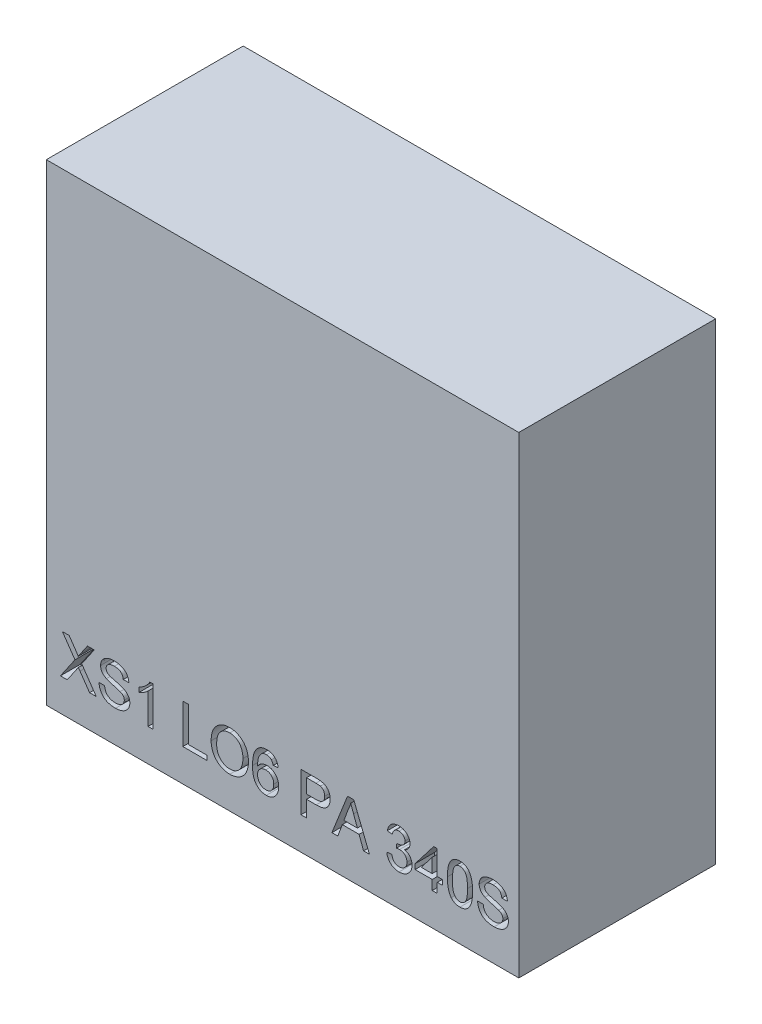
from build123d import *

# Parameters (mm, degrees)
ESQUISSE1_W             = 12
ESQUISSE1_H             = 12
EXTRUSION1_DEPTH        = 2.5
ENL_V_MAT_EXTRU_1_DEPTH = 0.5


with BuildPart() as part:
    # Esquisse1 → Extrusion1 (new, symmetric)
    with BuildSketch(Plane.XY):
        Rectangle(ESQUISSE1_W, ESQUISSE1_H)
    extrude(amount=EXTRUSION1_DEPTH, both=True)

    # Esquisse2 → Enl_v. mat.-Extru.1 (cut)
    # profile 1 of 12: a face of its own
    with BuildSketch(Plane.XY.offset(2.5)):
        with BuildLine():
            Line((-5.642281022, -5.175522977), (-5.272689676, -4.63746208))
            Line((-5.272689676, -4.63746208), (-5.590998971, -4.175522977))
            Line((-5.590998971, -4.175522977), (-5.421127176, -4.175522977))
            Line((-5.421127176, -4.175522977), (-5.246648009, -4.428728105))
            add(Edge.make_bspline(
                [(-5.246648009, -4.428728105), (-5.242364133, -4.435064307), (-5.234325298, -4.446954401), (-5.223150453, -4.463819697), (-5.214050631, -4.478787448), (-5.206443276, -4.491640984), (-5.20090615, -4.502590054), (-5.196861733, -4.51143256), (-5.194786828, -4.518440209), (-5.194771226, -4.522471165), (-5.194764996, -4.524080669)],
                knots=[0, 0, 0, 0, 1.676306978, 3.145645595, 4.433208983, 5.515054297, 6.418236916, 7.119612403, 7.648473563, 8, 8, 8, 8], degree=3))
            add(Edge.make_bspline(
                [(-5.194764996, -4.524080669), (-5.190487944, -4.517873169), (-5.181114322, -4.504268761), (-5.165991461, -4.482142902), (-5.148516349, -4.456622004), (-5.136074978, -4.438541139), (-5.129460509, -4.428928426)],
                knots=[0, 0, 0, 0, 0.783836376, 1.717861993, 2.786698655, 4, 4, 4, 4], degree=3))
            Line((-5.129460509, -4.428928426), (-4.955582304, -4.175522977))
            Line((-4.955582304, -4.175522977), (-4.783306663, -4.175522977))
            Line((-4.783306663, -4.175522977), (-5.101615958, -4.639064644))
            Line((-5.101615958, -4.639064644), (-4.732024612, -5.175522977))
            Line((-4.732024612, -5.175522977), (-4.902096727, -5.175522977))
            Line((-4.902096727, -5.175522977), (-5.14548615, -4.822157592))
            add(Edge.make_bspline(
                [(-5.14548615, -4.822157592), (-5.152441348, -4.812148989), (-5.166192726, -4.792360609), (-5.179817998, -4.772485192), (-5.186551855, -4.7626624)],
                knots=[0, 0, 0, 0, 1.011563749, 2, 2, 2, 2], degree=3))
            add(Edge.make_bspline(
                [(-5.186551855, -4.7626624), (-5.191679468, -4.770150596), (-5.201118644, -4.783935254), (-5.21425758, -4.80270564), (-5.224625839, -4.818254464), (-5.230881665, -4.827371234), (-5.233627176, -4.831372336)],
                knots=[0, 0, 0, 0, 1.307556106, 2.407017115, 3.300883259, 4, 4, 4, 4], degree=3))
            Line((-5.233627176, -4.831372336), (-5.470205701, -5.175522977))
            Line((-5.470205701, -5.175522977), (-5.642281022, -5.175522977))
        make_face()
    # profile 2 of 12: a face of its own
    with BuildSketch(Plane.XY.offset(2.5)):
        with BuildLine():
            Line((-4.66111115, -4.829369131), (-4.520085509, -4.829369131))
            add(Edge.make_bspline(
                [(-4.520085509, -4.829369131), (-4.518534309, -4.842031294), (-4.51555437, -4.866355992), (-4.507222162, -4.900832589), (-4.496498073, -4.931830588), (-4.483136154, -4.959761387), (-4.465559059, -4.984290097), (-4.444381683, -5.00641462), (-4.418662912, -5.025573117), (-4.389632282, -5.042622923), (-4.357300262, -5.056009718), (-4.322782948, -5.06593357), (-4.286244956, -5.071813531), (-4.261225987, -5.072571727), (-4.248450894, -5.072958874)],
                knots=[0, 0, 0, 0, 1.125557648, 2.162256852, 3.1243583, 4.018160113, 4.88511607, 5.777380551, 6.711250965, 7.707237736, 8.743031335, 9.791730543, 10.872421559, 12, 12, 12, 12], degree=3))
            add(Edge.make_bspline(
                [(-4.248450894, -5.072958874), (-4.237146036, -5.072749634), (-4.215103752, -5.072341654), (-4.183217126, -5.067440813), (-4.153211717, -5.060489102), (-4.125645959, -5.049973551), (-4.100621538, -5.037204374), (-4.078890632, -5.021759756), (-4.060337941, -5.004342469), (-4.045809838, -4.984493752), (-4.034396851, -4.963695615), (-4.026024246, -4.942317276), (-4.021036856, -4.920477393), (-4.020401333, -4.905782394), (-4.020085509, -4.898479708)],
                knots=[0, 0, 0, 0, 1.267006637, 2.470417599, 3.611360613, 4.716023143, 5.771382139, 6.754486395, 7.697536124, 8.612899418, 9.501261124, 10.352596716, 11.181322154, 12, 12, 12, 12], degree=3))
            add(Edge.make_bspline(
                [(-4.020085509, -4.898479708), (-4.02042313, -4.891250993), (-4.021083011, -4.87712248), (-4.025383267, -4.856553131), (-4.033556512, -4.837726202), (-4.044162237, -4.819873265), (-4.058916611, -4.803550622), (-4.077557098, -4.788510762), (-4.100494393, -4.77487548), (-4.117613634, -4.767408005), (-4.126656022, -4.763463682)],
                knots=[0, 0, 0, 0, 0.942140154, 1.841411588, 2.718743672, 3.605002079, 4.535543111, 5.568170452, 6.715506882, 8, 8, 8, 8], degree=3))
            add(Edge.make_bspline(
                [(-4.126656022, -4.763463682), (-4.13017907, -4.762017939), (-4.138138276, -4.758751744), (-4.151779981, -4.754427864), (-4.167967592, -4.748836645), (-4.187090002, -4.7430786), (-4.209044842, -4.736987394), (-4.233795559, -4.730093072), (-4.261328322, -4.722761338), (-4.290862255, -4.714957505), (-4.320682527, -4.707022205), (-4.349172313, -4.699079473), (-4.375384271, -4.691016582), (-4.399533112, -4.683253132), (-4.421494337, -4.675457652), (-4.441330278, -4.667843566), (-4.459065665, -4.660565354), (-4.469897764, -4.655213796), (-4.475013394, -4.652686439)],
                knots=[0, 0, 0, 0, 0.499201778, 1.127787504, 1.87543728, 2.745208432, 3.745951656, 4.863402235, 6.114490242, 7.482339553, 8.869366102, 10.161191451, 11.360587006, 12.46547846, 13.487450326, 14.41601931, 15.251940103, 16, 16, 16, 16], degree=3))
            add(Edge.make_bspline(
                [(-4.475013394, -4.652686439), (-4.486783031, -4.646328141), (-4.509501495, -4.634054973), (-4.540078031, -4.612110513), (-4.565841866, -4.587759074), (-4.586684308, -4.561035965), (-4.603017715, -4.532393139), (-4.614037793, -4.501781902), (-4.621585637, -4.469757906), (-4.622291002, -4.447736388), (-4.622649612, -4.436540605)],
                knots=[0, 0, 0, 0, 1.158441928, 2.236094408, 3.251151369, 4.220012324, 5.163146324, 6.095083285, 7.031536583, 8, 8, 8, 8], degree=3))
            add(Edge.make_bspline(
                [(-4.622649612, -4.436540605), (-4.622173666, -4.424143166), (-4.621227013, -4.399484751), (-4.612829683, -4.363300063), (-4.599435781, -4.328480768), (-4.584189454, -4.300837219), (-4.569320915, -4.279933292), (-4.556994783, -4.264878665), (-4.543168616, -4.250962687), (-4.52826821, -4.237991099), (-4.512027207, -4.226157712), (-4.494848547, -4.214976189), (-4.476110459, -4.205365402), (-4.449780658, -4.193133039), (-4.414557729, -4.18091788), (-4.370216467, -4.170273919), (-4.323548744, -4.164005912), (-4.291738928, -4.163143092), (-4.275494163, -4.162702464)],
                knots=[0, 0, 0, 0, 1.199927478, 2.386647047, 3.578628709, 4.806592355, 5.433127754, 6.062729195, 6.689531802, 7.331674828, 7.974827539, 8.635320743, 9.315455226, 10.01318112, 11.447700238, 12.918145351, 14.426146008, 16, 16, 16, 16], degree=3))
            add(Edge.make_bspline(
                [(-4.275494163, -4.162702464), (-4.257713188, -4.163109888), (-4.223090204, -4.163903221), (-4.17278203, -4.170503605), (-4.125858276, -4.181838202), (-4.089059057, -4.194526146), (-4.061853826, -4.207370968), (-4.042526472, -4.217393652), (-4.024586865, -4.2289817), (-4.007873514, -4.241521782), (-3.992231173, -4.255008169), (-3.978061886, -4.269761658), (-3.964750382, -4.285278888), (-3.949107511, -4.307556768), (-3.932241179, -4.337041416), (-3.91765794, -4.375239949), (-3.907639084, -4.415555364), (-3.905690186, -4.443426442), (-3.904700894, -4.457574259)],
                knots=[0, 0, 0, 0, 1.607600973, 3.130308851, 4.577334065, 5.967726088, 6.640410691, 7.296826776, 7.935019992, 8.569057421, 9.185393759, 9.8003086, 10.417295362, 11.032210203, 12.259799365, 13.477607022, 14.719591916, 16, 16, 16, 16], degree=3))
            Line((-3.904700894, -4.457574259), (-4.045726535, -4.457574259))
            add(Edge.make_bspline(
                [(-4.045726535, -4.457574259), (-4.046622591, -4.450413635), (-4.048375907, -4.436402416), (-4.052725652, -4.41611907), (-4.058823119, -4.39728081), (-4.065965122, -4.379711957), (-4.074622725, -4.363595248), (-4.084714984, -4.348775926), (-4.096364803, -4.335428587), (-4.109272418, -4.323200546), (-4.123830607, -4.312553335), (-4.139964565, -4.303311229), (-4.157701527, -4.295503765), (-4.177025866, -4.289109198), (-4.197941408, -4.284151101), (-4.220495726, -4.28050383), (-4.244680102, -4.278635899), (-4.261335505, -4.278273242), (-4.269885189, -4.27808708)],
                knots=[0, 0, 0, 0, 1.074487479, 2.102453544, 3.083708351, 4.020042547, 4.923259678, 5.803182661, 6.684453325, 7.556870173, 8.445961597, 9.363679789, 10.320905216, 11.327237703, 12.390948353, 13.519046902, 14.726457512, 16, 16, 16, 16], degree=3))
            add(Edge.make_bspline(
                [(-4.269885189, -4.27808708), (-4.278772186, -4.278154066), (-4.295975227, -4.278283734), (-4.320844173, -4.280647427), (-4.343894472, -4.283890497), (-4.365086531, -4.288674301), (-4.38435093, -4.294936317), (-4.401973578, -4.302167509), (-4.417461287, -4.311331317), (-4.431175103, -4.321538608), (-4.443005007, -4.332832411), (-4.453200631, -4.344733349), (-4.462217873, -4.356891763), (-4.46922447, -4.369972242), (-4.474928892, -4.383479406), (-4.478608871, -4.397667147), (-4.481214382, -4.412273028), (-4.481485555, -4.422238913), (-4.481623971, -4.427325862)],
                knots=[0, 0, 0, 0, 1.464176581, 2.834285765, 4.113735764, 5.29917439, 6.409476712, 7.449999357, 8.431575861, 9.367089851, 10.262376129, 11.120706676, 11.948504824, 12.751342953, 13.560717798, 14.359016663, 15.162382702, 16, 16, 16, 16], degree=3))
            add(Edge.make_bspline(
                [(-4.481623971, -4.427325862), (-4.481259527, -4.435929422), (-4.480552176, -4.45262814), (-4.473329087, -4.476351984), (-4.462219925, -4.497977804), (-4.45127563, -4.509744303), (-4.445766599, -4.515667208)],
                knots=[0, 0, 0, 0, 1.050964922, 2.039826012, 3.013306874, 4, 4, 4, 4], degree=3))
            add(Edge.make_bspline(
                [(-4.445766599, -4.515667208), (-4.442293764, -4.518627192), (-4.434613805, -4.525173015), (-4.420324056, -4.533835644), (-4.402606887, -4.542588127), (-4.381343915, -4.551288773), (-4.356571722, -4.560043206), (-4.328330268, -4.569056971), (-4.296511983, -4.578009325), (-4.26208653, -4.5866364), (-4.227308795, -4.595298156), (-4.194258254, -4.603926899), (-4.163912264, -4.612104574), (-4.136318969, -4.620080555), (-4.11144981, -4.627832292), (-4.089391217, -4.635522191), (-4.069964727, -4.642594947), (-4.058063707, -4.647571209), (-4.052537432, -4.649881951)],
                knots=[0, 0, 0, 0, 0.523891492, 1.158553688, 1.913783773, 2.794766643, 3.797521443, 4.933638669, 6.202080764, 7.596537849, 9.013317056, 10.322179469, 11.523240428, 12.626146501, 13.623953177, 14.517289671, 15.311498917, 16, 16, 16, 16], degree=3))
            add(Edge.make_bspline(
                [(-4.052537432, -4.649881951), (-4.045347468, -4.653196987), (-4.031234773, -4.659703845), (-4.01124225, -4.670813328), (-3.992587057, -4.682349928), (-3.975419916, -4.694624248), (-3.959796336, -4.707662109), (-3.945541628, -4.721314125), (-3.932569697, -4.735503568), (-3.92140396, -4.750684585), (-3.911378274, -4.76624349), (-3.902605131, -4.782397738), (-3.895541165, -4.79924233), (-3.889345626, -4.816574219), (-3.884889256, -4.834586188), (-3.881394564, -4.853096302), (-3.879356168, -4.872191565), (-3.879159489, -4.885120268), (-3.879059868, -4.89166881)],
                knots=[0, 0, 0, 0, 1.198900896, 2.353241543, 3.461831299, 4.520043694, 5.547003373, 6.541368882, 7.508191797, 8.454912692, 9.392021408, 10.310662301, 11.235020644, 12.156274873, 13.095836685, 14.042125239, 15.00831306, 16, 16, 16, 16], degree=3))
            add(Edge.make_bspline(
                [(-3.879059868, -4.89166881), (-3.879581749, -4.904737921), (-3.880617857, -4.930684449), (-3.889539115, -4.968930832), (-3.903553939, -5.005991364), (-3.919989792, -5.035400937), (-3.935526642, -5.057865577), (-3.948578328, -5.074012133), (-3.963051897, -5.088942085), (-3.978591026, -5.10312316), (-3.99531636, -5.116266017), (-4.013368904, -5.128375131), (-4.032558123, -5.139576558), (-4.059959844, -5.153226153), (-4.096353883, -5.167504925), (-4.142712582, -5.179395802), (-4.191569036, -5.187109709), (-4.225116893, -5.187926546), (-4.242240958, -5.18834349)],
                knots=[0, 0, 0, 0, 1.197055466, 2.376552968, 3.581957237, 4.820753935, 5.454298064, 6.085440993, 6.72202542, 7.359198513, 8.013298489, 8.67051481, 9.351020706, 10.049282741, 11.476266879, 12.925760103, 14.430794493, 16, 16, 16, 16], degree=3))
            add(Edge.make_bspline(
                [(-4.242240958, -5.18834349), (-4.253128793, -5.188253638), (-4.274456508, -5.188077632), (-4.305795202, -5.185946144), (-4.335827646, -5.182862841), (-4.364524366, -5.178270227), (-4.391795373, -5.172244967), (-4.417738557, -5.165009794), (-4.44241541, -5.156677), (-4.465739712, -5.14687778), (-4.487650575, -5.135492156), (-4.508541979, -5.123209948), (-4.528072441, -5.10928749), (-4.546283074, -5.093943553), (-4.563635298, -5.077621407), (-4.579409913, -5.059654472), (-4.594143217, -5.040568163), (-4.607498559, -5.020187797), (-4.619429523, -4.998780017), (-4.630158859, -4.976704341), (-4.639198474, -4.95380063), (-4.646483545, -4.930184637), (-4.652654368, -4.906014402), (-4.656933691, -4.881088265), (-4.660079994, -4.855484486), (-4.660765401, -4.838125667), (-4.66111115, -4.829369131)],
                knots=[0, 0, 0, 0, 1.259822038, 2.467811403, 3.633536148, 4.752793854, 5.829021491, 6.863980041, 7.868367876, 8.841470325, 9.788447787, 10.724101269, 11.643985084, 12.560193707, 13.478453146, 14.398077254, 15.323914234, 16.266973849, 17.21495974, 18.158525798, 19.105629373, 20.061269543, 21.017128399, 21.990322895, 22.986232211, 24, 24, 24, 24], degree=3))
        make_face()
    # profile 3 of 12: a face of its own
    with BuildSketch(Plane.XY.offset(2.5)):
        with BuildLine():
            Line((-3.289316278, -5.175522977), (-3.417521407, -5.175522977))
            Line((-3.417521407, -5.175522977), (-3.417521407, -4.396276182))
            add(Edge.make_bspline(
                [(-3.417521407, -4.396276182), (-3.424903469, -4.403395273), (-3.440246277, -4.418191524), (-3.466181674, -4.439131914), (-3.495128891, -4.460355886), (-3.52671203, -4.480765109), (-3.558905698, -4.499978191), (-3.590016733, -4.517257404), (-3.619525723, -4.531879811), (-3.638963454, -4.539875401), (-3.648290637, -4.54371208)],
                knots=[0, 0, 0, 0, 0.893362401, 1.856755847, 2.901947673, 4.020460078, 5.132200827, 6.168787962, 7.121294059, 8, 8, 8, 8], degree=3))
            Line((-3.648290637, -4.54371208), (-3.648290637, -4.425522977))
            add(Edge.make_bspline(
                [(-3.648290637, -4.425522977), (-3.632270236, -4.417272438), (-3.600694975, -4.401011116), (-3.556085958, -4.372925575), (-3.514438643, -4.342479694), (-3.476442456, -4.309680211), (-3.442381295, -4.276153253), (-3.413677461, -4.242323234), (-3.389659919, -4.209430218), (-3.377609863, -4.186490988), (-3.37184833, -4.175522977)],
                knots=[0, 0, 0, 0, 1.141258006, 2.249351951, 3.335817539, 4.406819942, 5.426913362, 6.360259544, 7.215985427, 8, 8, 8, 8], degree=3))
            Line((-3.37184833, -4.175522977), (-3.289316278, -4.175522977))
            Line((-3.289316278, -4.175522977), (-3.289316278, -5.175522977))
        make_face()
    # profile 4 of 12: a face of its own
    with BuildSketch(Plane.XY.offset(2.5)):
        Polygon((-2.532906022, -5.175522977), (-2.532906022, -4.175522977), (-2.391880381, -4.175522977), (-2.391880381, -5.060138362), (-1.917521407, -5.060138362), (-1.917521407, -5.175522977), align=None)
    # profile 5 of 12: a face of its own
    with BuildSketch(Plane.XY.offset(2.5)):
        with BuildLine():
            add(Edge.make_bspline(
                [(-1.814957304, -4.688744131), (-1.814609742, -4.668694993), (-1.813932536, -4.629630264), (-1.807605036, -4.572746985), (-1.797330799, -4.519227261), (-1.782642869, -4.46907526), (-1.764025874, -4.422212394), (-1.741393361, -4.37853255), (-1.714064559, -4.338530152), (-1.683148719, -4.301824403), (-1.648617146, -4.26937383), (-1.611850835, -4.240553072), (-1.572390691, -4.216513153), (-1.530601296, -4.196664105), (-1.486305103, -4.18142458), (-1.439626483, -4.170755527), (-1.390615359, -4.16387295), (-1.357115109, -4.163098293), (-1.339997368, -4.162702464)],
                knots=[0, 0, 0, 0, 1.203621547, 2.345195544, 3.432004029, 4.472479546, 5.478447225, 6.455936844, 7.420185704, 8.381829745, 9.332027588, 10.260832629, 11.182364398, 12.100723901, 13.034044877, 13.989196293, 14.972532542, 16, 16, 16, 16], degree=3))
            add(Edge.make_bspline(
                [(-1.339997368, -4.162702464), (-1.328707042, -4.162899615), (-1.306286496, -4.163291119), (-1.273139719, -4.166269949), (-1.240844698, -4.171586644), (-1.209433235, -4.178711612), (-1.178819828, -4.18805926), (-1.148986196, -4.199093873), (-1.120193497, -4.212767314), (-1.092250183, -4.22807609), (-1.065486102, -4.245199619), (-1.040333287, -4.264115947), (-1.016851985, -4.28468201), (-0.994726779, -4.306559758), (-0.974695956, -4.330487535), (-0.955931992, -4.35573646), (-0.93897408, -4.382754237), (-0.92376205, -4.411319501), (-0.910160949, -4.440991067), (-0.898536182, -4.471891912), (-0.888554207, -4.503651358), (-0.880198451, -4.536457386), (-0.874202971, -4.570298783), (-0.869428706, -4.605029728), (-0.866915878, -4.640763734), (-0.866466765, -4.664902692), (-0.866239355, -4.677125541)],
                knots=[0, 0, 0, 0, 1.034375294, 2.054082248, 3.045783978, 4.031219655, 5.002789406, 5.976610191, 6.94273282, 7.920236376, 8.894345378, 9.851183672, 10.800797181, 11.752517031, 12.698794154, 13.65688337, 14.632873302, 15.61821402, 16.620222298, 17.621258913, 18.640965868, 19.669244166, 20.720417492, 21.788124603, 22.880008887, 24, 24, 24, 24], degree=3))
            add(Edge.make_bspline(
                [(-0.866239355, -4.677125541), (-0.866447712, -4.689549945), (-0.866859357, -4.714096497), (-0.869644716, -4.750359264), (-0.874542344, -4.785581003), (-0.881038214, -4.819866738), (-0.889742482, -4.853145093), (-0.900086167, -4.885511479), (-0.912597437, -4.916773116), (-0.926727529, -4.947005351), (-0.942715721, -4.975792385), (-0.960351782, -5.002932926), (-0.979648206, -5.028173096), (-1.000311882, -5.051822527), (-1.022825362, -5.073458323), (-1.046911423, -5.093282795), (-1.072477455, -5.111482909), (-1.099609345, -5.127565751), (-1.127820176, -5.141662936), (-1.1565517, -5.154169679), (-1.185825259, -5.164835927), (-1.2157409, -5.173479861), (-1.246217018, -5.18001184), (-1.277167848, -5.184903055), (-1.308694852, -5.187719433), (-1.32990919, -5.188134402), (-1.34059833, -5.18834349)],
                knots=[0, 0, 0, 0, 1.141429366, 2.255090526, 3.338676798, 4.407031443, 5.458968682, 6.496860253, 7.526652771, 8.550250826, 9.560787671, 10.54935636, 11.521089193, 12.477323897, 13.431786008, 14.386110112, 15.340986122, 16.312041, 17.28047646, 18.236612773, 19.189437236, 20.140779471, 21.09494583, 22.051062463, 23.018000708, 24, 24, 24, 24], degree=3))
            add(Edge.make_bspline(
                [(-1.34059833, -5.18834349), (-1.352091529, -5.188173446), (-1.374856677, -5.187836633), (-1.40850418, -5.184474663), (-1.441314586, -5.179345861), (-1.473192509, -5.171941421), (-1.50409439, -5.162281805), (-1.534056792, -5.150590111), (-1.563185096, -5.137022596), (-1.591117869, -5.121190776), (-1.617760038, -5.103587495), (-1.642853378, -5.084300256), (-1.666384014, -5.06350681), (-1.687974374, -5.040863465), (-1.708323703, -5.017191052), (-1.726618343, -4.991609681), (-1.743455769, -4.964699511), (-1.758337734, -4.93620114), (-1.771781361, -4.906961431), (-1.783107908, -4.876971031), (-1.793061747, -4.846671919), (-1.800988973, -4.815877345), (-1.807306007, -4.784658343), (-1.811553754, -4.753066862), (-1.81462151, -4.721055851), (-1.814844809, -4.699568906), (-1.814957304, -4.688744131)],
                knots=[0, 0, 0, 0, 1.072727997, 2.12480551, 3.153819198, 4.171534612, 5.177148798, 6.173931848, 7.17235114, 8.174500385, 9.168706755, 10.151274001, 11.127173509, 12.097141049, 13.070188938, 14.039134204, 15.03036519, 16.031505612, 17.038625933, 18.033164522, 19.022845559, 20.014762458, 21.000193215, 21.994692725, 22.989758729, 24, 24, 24, 24], degree=3))
        make_face()
        with BuildLine():
            add(Edge.make_bspline(
                [(-1.673931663, -4.690346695), (-1.673715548, -4.704783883), (-1.673294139, -4.732935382), (-1.668472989, -4.773978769), (-1.661157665, -4.812705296), (-1.651074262, -4.849223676), (-1.6375197, -4.883172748), (-1.621313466, -4.914878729), (-1.601909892, -4.944130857), (-1.579737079, -4.970847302), (-1.555349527, -4.994847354), (-1.529288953, -5.015810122), (-1.501549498, -5.033364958), (-1.472438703, -5.047860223), (-1.44174748, -5.059175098), (-1.409567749, -5.067120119), (-1.375875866, -5.072089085), (-1.352902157, -5.072665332), (-1.341199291, -5.072958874)],
                knots=[0, 0, 0, 0, 1.215430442, 2.370003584, 3.475209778, 4.53279855, 5.55522989, 6.548792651, 7.526809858, 8.505409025, 9.467826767, 10.404123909, 11.316848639, 12.227335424, 13.138360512, 14.065900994, 15.014765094, 16, 16, 16, 16], degree=3))
            add(Edge.make_bspline(
                [(-1.341199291, -5.072958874), (-1.329298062, -5.072660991), (-1.305995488, -5.072077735), (-1.271795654, -5.067195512), (-1.239301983, -5.058883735), (-1.208192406, -5.047818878), (-1.179029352, -5.032861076), (-1.151130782, -5.015345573), (-1.125257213, -4.99394213), (-1.100773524, -4.969899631), (-1.078813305, -4.942570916), (-1.059328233, -4.912629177), (-1.043499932, -4.879625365), (-1.02983433, -4.844286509), (-1.019827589, -4.80594469), (-1.012431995, -4.765035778), (-1.007975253, -4.721428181), (-1.007505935, -4.691492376), (-1.007264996, -4.676123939)],
                knots=[0, 0, 0, 0, 0.976878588, 1.912725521, 2.8289017, 3.727303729, 4.617335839, 5.514666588, 6.426584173, 7.368641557, 8.327632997, 9.299405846, 10.294892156, 11.327373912, 12.405931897, 13.542618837, 14.738430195, 16, 16, 16, 16], degree=3))
            add(Edge.make_bspline(
                [(-1.007264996, -4.676123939), (-1.007350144, -4.666236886), (-1.007517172, -4.646842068), (-1.009729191, -4.618253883), (-1.012582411, -4.590554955), (-1.016926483, -4.563781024), (-1.022913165, -4.538042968), (-1.029545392, -4.513144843), (-1.037838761, -4.489301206), (-1.047248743, -4.466418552), (-1.057778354, -4.444614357), (-1.069654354, -4.424072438), (-1.082738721, -4.404872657), (-1.096678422, -4.386651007), (-1.11224536, -4.37011274), (-1.128689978, -4.354559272), (-1.146385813, -4.34031194), (-1.165156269, -4.327367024), (-1.184735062, -4.315714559), (-1.205081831, -4.305741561), (-1.225872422, -4.296981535), (-1.247454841, -4.290266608), (-1.269531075, -4.28485092), (-1.29219037, -4.280737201), (-1.31551683, -4.278606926), (-1.331246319, -4.278261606), (-1.339196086, -4.27808708)],
                knots=[0, 0, 0, 0, 1.220438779, 2.394059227, 3.538503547, 4.658058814, 5.74010225, 6.800155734, 7.837851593, 8.854470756, 9.853724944, 10.825214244, 11.781044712, 12.72106398, 13.654479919, 14.581868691, 15.514082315, 16.456304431, 17.39516604, 18.324312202, 19.252140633, 20.177768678, 21.111585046, 22.057694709, 23.018348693, 24, 24, 24, 24], degree=3))
            add(Edge.make_bspline(
                [(-1.339196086, -4.27808708), (-1.350431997, -4.27831022), (-1.372601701, -4.278750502), (-1.405238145, -4.283644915), (-1.436703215, -4.290957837), (-1.467045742, -4.301181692), (-1.496006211, -4.314719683), (-1.523734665, -4.331322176), (-1.550477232, -4.350537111), (-1.575812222, -4.372832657), (-1.599429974, -4.398444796), (-1.619396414, -4.428640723), (-1.636224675, -4.462699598), (-1.650275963, -4.500535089), (-1.660989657, -4.542440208), (-1.668394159, -4.588234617), (-1.67306921, -4.637966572), (-1.673636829, -4.672440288), (-1.673931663, -4.690346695)],
                knots=[0, 0, 0, 0, 0.895090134, 1.766112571, 2.624765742, 3.468151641, 4.313618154, 5.168136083, 6.041303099, 6.935189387, 7.854749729, 8.809996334, 9.809869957, 10.877771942, 12.021723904, 13.25217762, 14.572720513, 16, 16, 16, 16], degree=3))
        make_face(mode=Mode.SUBTRACT)
    # profile 6 of 12: a face of its own
    with BuildSketch(Plane.XY.offset(2.5)):
        with BuildLine():
            Line((-0.109829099, -4.431933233), (-0.238034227, -4.444753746))
            add(Edge.make_bspline(
                [(-0.238034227, -4.444753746), (-0.240800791, -4.433727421), (-0.246008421, -4.412972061), (-0.256928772, -4.384820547), (-0.268962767, -4.361009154), (-0.279417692, -4.348187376), (-0.284308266, -4.342189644)],
                knots=[0, 0, 0, 0, 1.199207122, 2.257322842, 3.184815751, 4, 4, 4, 4], degree=3))
            add(Edge.make_bspline(
                [(-0.284308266, -4.342189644), (-0.288506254, -4.338098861), (-0.296762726, -4.330053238), (-0.310316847, -4.319565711), (-0.324605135, -4.310680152), (-0.339670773, -4.303481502), (-0.355432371, -4.297794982), (-0.371955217, -4.293816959), (-0.389201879, -4.291354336), (-0.400953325, -4.291057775), (-0.406904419, -4.290907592)],
                knots=[0, 0, 0, 0, 1.028360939, 2.022547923, 3.001693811, 3.976902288, 4.948369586, 5.937776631, 6.955661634, 8, 8, 8, 8], degree=3))
            add(Edge.make_bspline(
                [(-0.406904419, -4.290907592), (-0.416552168, -4.291218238), (-0.435615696, -4.29183206), (-0.463585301, -4.29784133), (-0.490751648, -4.306835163), (-0.507582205, -4.315952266), (-0.516079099, -4.320555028)],
                knots=[0, 0, 0, 0, 1.010336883, 1.996381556, 2.988474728, 4, 4, 4, 4], degree=3))
            add(Edge.make_bspline(
                [(-0.516079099, -4.320555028), (-0.524435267, -4.327478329), (-0.54158848, -4.34169021), (-0.563973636, -4.367950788), (-0.583992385, -4.398525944), (-0.598756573, -4.42707018), (-0.60914714, -4.452662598), (-0.615867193, -4.474596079), (-0.621608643, -4.498828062), (-0.626391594, -4.525312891), (-0.630090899, -4.554072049), (-0.633182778, -4.585123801), (-0.634892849, -4.618546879), (-0.635273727, -4.641600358), (-0.635470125, -4.653487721)],
                knots=[0, 0, 0, 0, 1.063306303, 2.18271343, 3.369442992, 4.644240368, 5.329284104, 6.077448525, 6.892756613, 7.771869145, 8.717113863, 9.73749892, 10.833357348, 12, 12, 12, 12], degree=3))
            add(Edge.make_bspline(
                [(-0.635470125, -4.653487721), (-0.627911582, -4.642868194), (-0.613115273, -4.622079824), (-0.587013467, -4.594887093), (-0.5585115, -4.571900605), (-0.527577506, -4.553547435), (-0.49501865, -4.539323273), (-0.461552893, -4.529087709), (-0.42723889, -4.522804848), (-0.4041261, -4.522054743), (-0.392481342, -4.521676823)],
                knots=[0, 0, 0, 0, 1.083917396, 2.121834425, 3.126226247, 4.123362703, 5.106535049, 6.077135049, 7.031216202, 8, 8, 8, 8], degree=3))
            add(Edge.make_bspline(
                [(-0.392481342, -4.521676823), (-0.382452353, -4.521946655), (-0.362638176, -4.52247976), (-0.333459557, -4.52670437), (-0.305485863, -4.534093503), (-0.278474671, -4.543719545), (-0.252945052, -4.556862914), (-0.228273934, -4.572223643), (-0.205032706, -4.590915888), (-0.182927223, -4.611918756), (-0.16280104, -4.635269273), (-0.144987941, -4.660401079), (-0.130143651, -4.687374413), (-0.118106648, -4.71600863), (-0.10868559, -4.746199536), (-0.101840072, -4.778032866), (-0.097832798, -4.811571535), (-0.097287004, -4.834499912), (-0.097008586, -4.846196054)],
                knots=[0, 0, 0, 0, 0.981553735, 1.939246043, 2.877808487, 3.810434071, 4.740031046, 5.683044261, 6.650811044, 7.654063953, 8.664382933, 9.663624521, 10.66421212, 11.671863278, 12.699354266, 13.755775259, 14.855184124, 16, 16, 16, 16], degree=3))
            add(Edge.make_bspline(
                [(-0.097008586, -4.846196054), (-0.097507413, -4.861653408), (-0.098491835, -4.892158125), (-0.106393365, -4.937080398), (-0.119125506, -4.980381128), (-0.13435637, -5.014671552), (-0.148349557, -5.04094168), (-0.160231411, -5.059316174), (-0.172936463, -5.076583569), (-0.186224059, -5.092981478), (-0.201057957, -5.107759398), (-0.216538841, -5.121613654), (-0.233178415, -5.134065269), (-0.250487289, -5.145528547), (-0.26879244, -5.155468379), (-0.287561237, -5.164300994), (-0.306948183, -5.171824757), (-0.327015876, -5.177732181), (-0.34766154, -5.182619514), (-0.368953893, -5.185980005), (-0.390836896, -5.188052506), (-0.405631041, -5.188245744), (-0.413114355, -5.18834349)],
                knots=[0, 0, 0, 0, 1.777979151, 3.508799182, 5.232661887, 6.960203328, 7.816385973, 8.656273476, 9.47551652, 10.283326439, 11.082130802, 11.882412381, 12.672407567, 13.471692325, 14.269609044, 15.067192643, 15.857822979, 16.66013129, 17.472860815, 18.297850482, 19.139002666, 20, 20, 20, 20], degree=3))
            add(Edge.make_bspline(
                [(-0.413114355, -5.18834349), (-0.425752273, -5.187993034), (-0.450537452, -5.187305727), (-0.486814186, -5.18202553), (-0.521260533, -5.173201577), (-0.553949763, -5.160864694), (-0.58498146, -5.145289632), (-0.614049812, -5.125765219), (-0.641315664, -5.102870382), (-0.666800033, -5.076472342), (-0.689906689, -5.045990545), (-0.709654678, -5.010805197), (-0.726481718, -4.971224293), (-0.740253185, -4.927138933), (-0.750674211, -4.878503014), (-0.758177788, -4.82542099), (-0.762792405, -4.76788526), (-0.76337409, -4.728015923), (-0.763675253, -4.707373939)],
                knots=[0, 0, 0, 0, 0.898506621, 1.76212948, 2.600594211, 3.422599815, 4.24233914, 5.064166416, 5.906856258, 6.769969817, 7.668413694, 8.619051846, 9.63165591, 10.722000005, 11.898403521, 13.164960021, 14.532183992, 16, 16, 16, 16], degree=3))
            add(Edge.make_bspline(
                [(-0.763675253, -4.707373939), (-0.763625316, -4.695619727), (-0.763526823, -4.672436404), (-0.761944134, -4.638316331), (-0.760128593, -4.605365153), (-0.757017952, -4.57371433), (-0.753345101, -4.543221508), (-0.748416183, -4.514066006), (-0.743123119, -4.486021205), (-0.736687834, -4.459307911), (-0.729514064, -4.433674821), (-0.721256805, -4.409403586), (-0.712535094, -4.38618018), (-0.702640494, -4.364370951), (-0.692095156, -4.343620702), (-0.680438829, -4.324313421), (-0.668214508, -4.306007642), (-0.659190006, -4.294719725), (-0.654700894, -4.289104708)],
                knots=[0, 0, 0, 0, 1.28053818, 2.525659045, 3.721026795, 4.875695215, 5.990149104, 7.066600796, 8.096771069, 9.099076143, 10.059445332, 10.995815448, 11.891625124, 12.761078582, 13.603822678, 14.426062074, 15.217066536, 16, 16, 16, 16], degree=3))
            add(Edge.make_bspline(
                [(-0.654700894, -4.289104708), (-0.646625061, -4.280020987), (-0.630706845, -4.26211613), (-0.603475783, -4.238987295), (-0.574458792, -4.219231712), (-0.543193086, -4.203270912), (-0.509917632, -4.190827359), (-0.474611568, -4.181794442), (-0.437176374, -4.176555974), (-0.411595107, -4.175872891), (-0.398490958, -4.175522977)],
                knots=[0, 0, 0, 0, 1.005002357, 1.980952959, 2.948226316, 3.90482984, 4.879026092, 5.883055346, 6.915583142, 8, 8, 8, 8], degree=3))
            add(Edge.make_bspline(
                [(-0.398490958, -4.175522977), (-0.388733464, -4.175695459), (-0.369564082, -4.176034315), (-0.341476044, -4.179285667), (-0.314759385, -4.184719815), (-0.289354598, -4.192049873), (-0.265409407, -4.201807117), (-0.242647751, -4.213370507), (-0.221300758, -4.227280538), (-0.201522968, -4.243347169), (-0.183265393, -4.261114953), (-0.166912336, -4.280733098), (-0.152525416, -4.301957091), (-0.139992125, -4.324831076), (-0.129424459, -4.349246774), (-0.12074788, -4.375309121), (-0.1141531, -4.403011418), (-0.111290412, -4.422158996), (-0.109829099, -4.431933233)],
                knots=[0, 0, 0, 0, 1.095988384, 2.15315746, 3.171326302, 4.156539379, 5.119213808, 6.072133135, 7.021027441, 7.975952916, 8.930907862, 9.879001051, 10.840359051, 11.807350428, 12.805278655, 13.825435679, 14.889953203, 16, 16, 16, 16], degree=3))
        make_face()
        with BuildLine():
            add(Edge.make_bspline(
                [(-0.635470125, -4.843591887), (-0.635113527, -4.85363029), (-0.634405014, -4.873575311), (-0.628985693, -4.903180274), (-0.620135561, -4.932065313), (-0.608006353, -4.959909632), (-0.593029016, -4.985779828), (-0.57523943, -5.008702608), (-0.555023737, -5.028341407), (-0.532490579, -5.044738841), (-0.50769285, -5.057339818), (-0.481074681, -5.066466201), (-0.452604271, -5.071982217), (-0.432970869, -5.072628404), (-0.42293006, -5.072958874)],
                knots=[0, 0, 0, 0, 1.034121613, 2.054667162, 3.090870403, 4.141799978, 5.178094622, 6.163726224, 7.122467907, 8.07367165, 9.024701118, 9.977919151, 10.965878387, 12, 12, 12, 12], degree=3))
            add(Edge.make_bspline(
                [(-0.42293006, -5.072958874), (-0.415774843, -5.072765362), (-0.401808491, -5.072387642), (-0.381359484, -5.069460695), (-0.361848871, -5.064959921), (-0.343389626, -5.058310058), (-0.326006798, -5.049823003), (-0.30961013, -5.039493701), (-0.294210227, -5.027291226), (-0.279993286, -5.013237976), (-0.267144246, -4.997608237), (-0.255980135, -4.980497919), (-0.246121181, -4.962188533), (-0.238705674, -4.942230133), (-0.23266311, -4.921134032), (-0.228220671, -4.898700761), (-0.225612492, -4.874904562), (-0.225348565, -4.858555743), (-0.225213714, -4.850202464)],
                knots=[0, 0, 0, 0, 1.023436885, 1.997658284, 2.950132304, 3.883974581, 4.798406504, 5.712938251, 6.651509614, 7.604127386, 8.56812849, 9.540661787, 10.523651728, 11.536824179, 12.580180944, 13.661349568, 14.805088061, 16, 16, 16, 16], degree=3))
            add(Edge.make_bspline(
                [(-0.225213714, -4.850202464), (-0.225338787, -4.842180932), (-0.225583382, -4.826493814), (-0.228335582, -4.803602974), (-0.232344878, -4.781963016), (-0.238499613, -4.761756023), (-0.246053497, -4.742768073), (-0.25551843, -4.725141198), (-0.266546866, -4.708725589), (-0.279477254, -4.693955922), (-0.293617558, -4.680499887), (-0.309147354, -4.668812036), (-0.325880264, -4.658941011), (-0.343876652, -4.650859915), (-0.363170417, -4.644666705), (-0.383721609, -4.640374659), (-0.40541459, -4.637378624), (-0.420315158, -4.637168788), (-0.427938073, -4.637061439)],
                knots=[0, 0, 0, 0, 1.155658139, 2.260035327, 3.319019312, 4.323913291, 5.299809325, 6.260058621, 7.202437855, 8.144128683, 9.083751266, 10.011616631, 10.939332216, 11.87851101, 12.849505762, 13.853846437, 14.90205895, 16, 16, 16, 16], degree=3))
            add(Edge.make_bspline(
                [(-0.427938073, -4.637061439), (-0.435027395, -4.637172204), (-0.448997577, -4.637390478), (-0.469484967, -4.640409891), (-0.489230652, -4.644710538), (-0.508155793, -4.650967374), (-0.526266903, -4.659024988), (-0.543559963, -4.668826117), (-0.559884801, -4.680651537), (-0.575390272, -4.693894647), (-0.589538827, -4.708605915), (-0.601952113, -4.724521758), (-0.612076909, -4.74174457), (-0.620927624, -4.759853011), (-0.627412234, -4.77927395), (-0.632026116, -4.799747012), (-0.634886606, -4.821275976), (-0.635272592, -4.836037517), (-0.635470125, -4.843591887)],
                knots=[0, 0, 0, 0, 1.036988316, 2.04348404, 3.025371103, 3.992992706, 4.955812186, 5.923433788, 6.897355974, 7.902569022, 8.905116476, 9.880852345, 10.849905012, 11.825004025, 12.826645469, 13.839294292, 14.894236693, 16, 16, 16, 16], degree=3))
        make_face(mode=Mode.SUBTRACT)
    # profile 7 of 12: a face of its own
    with BuildSketch(Plane.XY.offset(2.5)):
        with BuildLine():
            Line((0.467093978, -5.175522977), (0.467093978, -4.175522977))
            Line((0.467093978, -4.175522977), (0.834481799, -4.175522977))
            add(Edge.make_bspline(
                [(0.834481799, -4.175522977), (0.849709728, -4.175609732), (0.87830785, -4.175772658), (0.91824476, -4.177680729), (0.952539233, -4.180041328), (0.973253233, -4.183402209), (0.982718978, -4.184938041)],
                knots=[0, 0, 0, 0, 1.22865052, 2.30741144, 3.226532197, 4, 4, 4, 4], degree=3))
            add(Edge.make_bspline(
                [(0.982718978, -4.184938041), (0.994264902, -4.18716008), (1.016644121, -4.191467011), (1.048329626, -4.201850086), (1.077196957, -4.214771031), (1.103200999, -4.230869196), (1.126773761, -4.249780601), (1.147579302, -4.272440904), (1.166021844, -4.29834414), (1.181703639, -4.327470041), (1.19475633, -4.358809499), (1.203898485, -4.392196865), (1.209754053, -4.427052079), (1.21037039, -4.450872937), (1.210683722, -4.462982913)],
                knots=[0, 0, 0, 0, 1.070909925, 2.075721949, 3.031861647, 3.947440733, 4.85625699, 5.777986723, 6.742441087, 7.747548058, 8.78749499, 9.830146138, 10.896896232, 12, 12, 12, 12], degree=3))
            add(Edge.make_bspline(
                [(1.210683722, -4.462982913), (1.210462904, -4.473344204), (1.210028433, -4.493730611), (1.206297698, -4.523681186), (1.200413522, -4.552494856), (1.191636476, -4.579974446), (1.180906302, -4.606441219), (1.167383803, -4.631448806), (1.151593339, -4.65533679), (1.133476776, -4.678040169), (1.112148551, -4.69909824), (1.086488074, -4.716961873), (1.056990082, -4.731962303), (1.023647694, -4.744082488), (0.986541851, -4.753619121), (0.945550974, -4.760606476), (0.900595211, -4.764464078), (0.869344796, -4.76499222), (0.853111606, -4.765266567)],
                knots=[0, 0, 0, 0, 0.928769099, 1.82740408, 2.702266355, 3.562020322, 4.410419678, 5.259600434, 6.10654066, 6.975254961, 7.860221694, 8.783881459, 9.766664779, 10.81996744, 11.958551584, 13.197863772, 14.544415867, 16, 16, 16, 16], degree=3))
            Line((0.853111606, -4.765266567), (0.608119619, -4.765266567))
            Line((0.608119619, -4.765266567), (0.608119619, -5.175522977))
            Line((0.608119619, -5.175522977), (0.467093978, -5.175522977))
        make_face()
        with BuildLine():
            Line((0.608119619, -4.649881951), (0.849305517, -4.649881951))
            add(Edge.make_bspline(
                [(0.849305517, -4.649881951), (0.858924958, -4.649721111), (0.87745592, -4.649411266), (0.904232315, -4.647249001), (0.928806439, -4.64350622), (0.951246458, -4.638286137), (0.971580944, -4.631797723), (0.989773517, -4.623591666), (1.005730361, -4.613748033), (1.019557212, -4.602367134), (1.031426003, -4.589617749), (1.041710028, -4.575708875), (1.050447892, -4.560541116), (1.057297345, -4.544051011), (1.063099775, -4.526559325), (1.06672154, -4.50770363), (1.069239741, -4.48775736), (1.069516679, -4.474009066), (1.069658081, -4.466989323)],
                knots=[0, 0, 0, 0, 1.403696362, 2.704090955, 3.91683431, 5.027708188, 6.063065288, 7.026749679, 7.932587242, 8.790956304, 9.632005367, 10.468072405, 11.310475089, 12.179234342, 13.069796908, 13.994719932, 14.976123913, 16, 16, 16, 16], degree=3))
            add(Edge.make_bspline(
                [(1.069658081, -4.466989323), (1.06935935, -4.456809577), (1.068780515, -4.437084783), (1.062948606, -4.408701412), (1.053805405, -4.382474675), (1.040715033, -4.358901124), (1.024871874, -4.338220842), (1.006248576, -4.321300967), (0.985442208, -4.307774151), (0.969907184, -4.302418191), (0.962085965, -4.299721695)],
                knots=[0, 0, 0, 0, 1.143156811, 2.215038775, 3.243253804, 4.254666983, 5.233799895, 6.158487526, 7.072877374, 8, 8, 8, 8], degree=3))
            add(Edge.make_bspline(
                [(0.962085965, -4.299721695), (0.959221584, -4.29902129), (0.952997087, -4.297499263), (0.942686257, -4.29577174), (0.930736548, -4.294135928), (0.917089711, -4.293050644), (0.901870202, -4.291972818), (0.885031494, -4.291475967), (0.866535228, -4.29104683), (0.853646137, -4.290955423), (0.84690167, -4.290907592)],
                knots=[0, 0, 0, 0, 0.611063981, 1.327884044, 2.165719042, 3.110592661, 4.16481496, 5.328235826, 6.601947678, 8, 8, 8, 8], degree=3))
            Line((0.84690167, -4.290907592), (0.608119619, -4.290907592))
            Line((0.608119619, -4.290907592), (0.608119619, -4.649881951))
        make_face(mode=Mode.SUBTRACT)
    # profile 8 of 12: a face of its own
    with BuildSketch(Plane.XY.offset(2.5)):
        Polygon((1.253351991, -5.175522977), (1.650387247, -4.175522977), (1.809441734, -4.175522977), (2.206476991, -5.175522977), (2.056837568, -5.175522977), (1.943055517, -4.867830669), (1.516773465, -4.867830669), (1.402991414, -5.175522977), align=None)
        with BuildLine():
            Line((1.559241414, -4.752446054), (1.900587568, -4.752446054))
            Line((1.900587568, -4.752446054), (1.803432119, -4.489625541))
            add(Edge.make_bspline(
                [(1.803432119, -4.489625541), (1.799707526, -4.479470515), (1.792425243, -4.459615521), (1.781565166, -4.43076789), (1.771643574, -4.403372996), (1.761914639, -4.377823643), (1.753132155, -4.353748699), (1.745037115, -4.331310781), (1.737031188, -4.310665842), (1.732226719, -4.297327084), (1.729914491, -4.290907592)],
                knots=[0, 0, 0, 0, 1.225184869, 2.395467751, 3.491410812, 4.525364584, 5.492066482, 6.394148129, 7.227157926, 8, 8, 8, 8], degree=3))
            add(Edge.make_bspline(
                [(1.729914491, -4.290907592), (1.726089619, -4.306737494), (1.718424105, -4.338462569), (1.702374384, -4.38494406), (1.68401406, -4.431000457), (1.66910329, -4.460678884), (1.661605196, -4.475603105)],
                knots=[0, 0, 0, 0, 0.9891762, 1.982431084, 2.985436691, 4, 4, 4, 4], degree=3))
            Line((1.661605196, -4.475603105), (1.559241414, -4.752446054))
        make_face(mode=Mode.SUBTRACT)
    # profile 9 of 12: a face of its own
    with BuildSketch(Plane.XY.offset(2.5)):
        with BuildLine():
            Line((2.646581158, -4.906292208), (2.774786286, -4.893471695))
            add(Edge.make_bspline(
                [(2.774786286, -4.893471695), (2.776495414, -4.901175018), (2.779802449, -4.916080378), (2.78616559, -4.937433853), (2.792886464, -4.957254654), (2.801218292, -4.975099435), (2.809348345, -4.991697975), (2.818902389, -5.006364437), (2.82911107, -5.01948149), (2.840163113, -5.031000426), (2.852185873, -5.040919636), (2.865019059, -5.04959948), (2.878934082, -5.056848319), (2.893824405, -5.062587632), (2.909564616, -5.067233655), (2.926240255, -5.070645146), (2.943939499, -5.072677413), (2.956070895, -5.072863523), (2.962286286, -5.072958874)],
                knots=[0, 0, 0, 0, 1.321063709, 2.556160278, 3.730472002, 4.821700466, 5.852032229, 6.822994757, 7.746964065, 8.632786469, 9.490489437, 10.352773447, 11.223141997, 12.11199479, 13.021433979, 13.96892724, 14.959401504, 16, 16, 16, 16], degree=3))
            add(Edge.make_bspline(
                [(2.962286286, -5.072958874), (2.969576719, -5.072854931), (2.983814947, -5.072651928), (3.004562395, -5.069606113), (3.02430725, -5.065423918), (3.042767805, -5.058865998), (3.060201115, -5.050851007), (3.07650786, -5.040946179), (3.091799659, -5.029315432), (3.105774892, -5.015879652), (3.118272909, -5.001099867), (3.129404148, -4.985488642), (3.138608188, -4.96891277), (3.146365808, -4.951605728), (3.152091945, -4.933287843), (3.15628394, -4.91418753), (3.159023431, -4.894218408), (3.15927386, -4.880593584), (3.15940167, -4.873639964)],
                knots=[0, 0, 0, 0, 1.111377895, 2.170522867, 3.193923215, 4.186422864, 5.152846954, 6.117443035, 7.091571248, 8.078879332, 9.069127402, 10.041602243, 10.999610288, 11.957618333, 12.930786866, 13.922135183, 14.939532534, 16, 16, 16, 16], degree=3))
            add(Edge.make_bspline(
                [(3.15940167, -4.873639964), (3.159251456, -4.867022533), (3.158957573, -4.854076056), (3.156541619, -4.835073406), (3.152325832, -4.817034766), (3.146481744, -4.799855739), (3.139014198, -4.783561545), (3.130038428, -4.768017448), (3.119060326, -4.753564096), (3.106703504, -4.740046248), (3.093225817, -4.727592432), (3.078476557, -4.716998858), (3.062954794, -4.707856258), (3.046475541, -4.700473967), (3.029107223, -4.694614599), (3.010866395, -4.690403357), (2.991665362, -4.687986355), (2.978585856, -4.687692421), (2.97190167, -4.687542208)],
                knots=[0, 0, 0, 0, 1.072815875, 2.098878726, 3.09954706, 4.07199174, 5.036203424, 6.001873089, 6.97636515, 7.972747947, 8.969130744, 9.945905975, 10.911575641, 11.885646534, 12.868345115, 13.879560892, 14.916365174, 16, 16, 16, 16], degree=3))
            add(Edge.make_bspline(
                [(2.97190167, -4.687542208), (2.966016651, -4.68769812), (2.953527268, -4.688029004), (2.933814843, -4.690950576), (2.911979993, -4.695041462), (2.896891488, -4.699056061), (2.888968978, -4.701164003)],
                knots=[0, 0, 0, 0, 0.837610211, 1.777604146, 2.833088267, 4, 4, 4, 4], degree=3))
            Line((2.888968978, -4.701164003), (2.902190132, -4.585779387))
            add(Edge.make_bspline(
                [(2.902190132, -4.585779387), (2.905659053, -4.586158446), (2.911787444, -4.586828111), (2.917946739, -4.587074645), (2.920619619, -4.587181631)],
                knots=[0, 0, 0, 0, 1.132082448, 2, 2, 2, 2], degree=3))
            add(Edge.make_bspline(
                [(2.920619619, -4.587181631), (2.932410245, -4.586731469), (2.955539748, -4.585848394), (2.989258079, -4.578510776), (3.021213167, -4.566957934), (3.045900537, -4.553173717), (3.064207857, -4.540208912), (3.075752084, -4.528519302), (3.086159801, -4.516114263), (3.093924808, -4.501885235), (3.100633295, -4.486766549), (3.104787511, -4.47016264), (3.107817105, -4.452477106), (3.10801697, -4.440227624), (3.108119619, -4.433936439)],
                knots=[0, 0, 0, 0, 1.557468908, 3.055264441, 4.54122591, 6.035034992, 6.780215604, 7.498173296, 8.201377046, 8.913174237, 9.633083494, 10.382644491, 11.169345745, 12, 12, 12, 12], degree=3))
            add(Edge.make_bspline(
                [(3.108119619, -4.433936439), (3.108024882, -4.428854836), (3.107839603, -4.418916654), (3.105775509, -4.40434623), (3.102361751, -4.390540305), (3.097747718, -4.377351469), (3.09170057, -4.364848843), (3.084201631, -4.353047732), (3.075633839, -4.341708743), (3.065519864, -4.331417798), (3.054688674, -4.32175613), (3.042745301, -4.313619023), (3.030258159, -4.3063904), (3.016786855, -4.300928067), (3.002663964, -4.296437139), (2.987768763, -4.293290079), (2.972095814, -4.291176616), (2.961358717, -4.290998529), (2.955876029, -4.290907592)],
                knots=[0, 0, 0, 0, 1.041493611, 2.036867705, 3.009952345, 3.954088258, 4.897230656, 5.850851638, 6.817653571, 7.805463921, 8.805067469, 9.788883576, 10.763797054, 11.758134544, 12.762883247, 13.799594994, 14.876406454, 16, 16, 16, 16], degree=3))
            add(Edge.make_bspline(
                [(2.955876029, -4.290907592), (2.945146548, -4.291325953), (2.924426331, -4.292133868), (2.894760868, -4.299608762), (2.867878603, -4.311704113), (2.84797627, -4.325888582), (2.833843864, -4.339449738), (2.824190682, -4.350944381), (2.815556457, -4.363637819), (2.80791672, -4.377525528), (2.801374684, -4.392663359), (2.79547722, -4.408863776), (2.790912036, -4.426386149), (2.788727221, -4.438527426), (2.787606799, -4.444753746)],
                knots=[0, 0, 0, 0, 1.533565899, 2.961543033, 4.347411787, 5.731829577, 6.434842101, 7.147085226, 7.87612511, 8.629021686, 9.412189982, 10.234506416, 11.094615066, 12, 12, 12, 12], degree=3))
            Line((2.787606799, -4.444753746), (2.65940167, -4.431933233))
            add(Edge.make_bspline(
                [(2.65940167, -4.431933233), (2.661407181, -4.422020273), (2.665341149, -4.402575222), (2.673355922, -4.374491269), (2.683129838, -4.348128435), (2.694865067, -4.323607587), (2.708007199, -4.30063527), (2.723167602, -4.27948397), (2.73999084, -4.26002794), (2.758506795, -4.242326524), (2.778464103, -4.22651718), (2.799762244, -4.212879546), (2.822226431, -4.201319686), (2.845877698, -4.192000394), (2.870697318, -4.184422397), (2.896755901, -4.179401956), (2.923935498, -4.17600588), (2.942443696, -4.175685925), (2.951869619, -4.175522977)],
                knots=[0, 0, 0, 0, 1.136581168, 2.229493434, 3.279335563, 4.293305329, 5.282068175, 6.250623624, 7.213783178, 8.169396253, 9.125981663, 10.071280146, 11.007896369, 11.961295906, 12.925420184, 13.920544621, 14.940967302, 16, 16, 16, 16], degree=3))
            add(Edge.make_bspline(
                [(2.951869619, -4.175522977), (2.964917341, -4.175946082), (2.99057338, -4.176778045), (3.028256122, -4.183385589), (3.064299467, -4.194228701), (3.098413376, -4.209259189), (3.130010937, -4.227626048), (3.157972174, -4.249637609), (3.181923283, -4.274913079), (3.201399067, -4.303176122), (3.216821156, -4.333267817), (3.228233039, -4.364504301), (3.23505181, -4.396849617), (3.235899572, -4.418747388), (3.236324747, -4.429729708)],
                knots=[0, 0, 0, 0, 1.104647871, 2.172094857, 3.229560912, 4.285649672, 5.322588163, 6.317201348, 7.289435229, 8.260615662, 9.214246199, 10.146367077, 11.070353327, 12, 12, 12, 12], degree=3))
            add(Edge.make_bspline(
                [(3.236324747, -4.429729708), (3.235893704, -4.440111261), (3.235042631, -4.460609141), (3.228490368, -4.490580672), (3.217418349, -4.518975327), (3.202453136, -4.545892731), (3.183046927, -4.570750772), (3.159253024, -4.592901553), (3.131452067, -4.612557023), (3.110617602, -4.622787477), (3.099906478, -4.628047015)],
                knots=[0, 0, 0, 0, 0.975609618, 1.926294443, 2.868398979, 3.832526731, 4.812148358, 5.820404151, 6.879456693, 8, 8, 8, 8], degree=3))
            add(Edge.make_bspline(
                [(3.099906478, -4.628047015), (3.107087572, -4.6298601), (3.121153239, -4.633411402), (3.141354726, -4.640769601), (3.160346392, -4.6493842), (3.178381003, -4.659141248), (3.194934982, -4.670680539), (3.210578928, -4.683297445), (3.224721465, -4.697599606), (3.237772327, -4.713077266), (3.249647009, -4.729568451), (3.25963967, -4.74739395), (3.268263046, -4.766085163), (3.275616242, -4.785777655), (3.280900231, -4.806623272), (3.284678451, -4.828460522), (3.287171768, -4.851213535), (3.287460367, -4.866755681), (3.287606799, -4.874641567)],
                knots=[0, 0, 0, 0, 1.053251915, 2.063013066, 3.05373318, 4.018979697, 4.975584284, 5.920798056, 6.874756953, 7.832116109, 8.799604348, 9.761196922, 10.734637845, 11.72654167, 12.747371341, 13.789206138, 14.878271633, 16, 16, 16, 16], degree=3))
            add(Edge.make_bspline(
                [(3.287606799, -4.874641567), (3.287362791, -4.885407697), (3.286883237, -4.906566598), (3.282337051, -4.937649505), (3.274907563, -4.967431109), (3.264626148, -4.996012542), (3.251597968, -5.023510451), (3.235249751, -5.049536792), (3.216066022, -5.074303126), (3.19434669, -5.097572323), (3.170551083, -5.118957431), (3.144709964, -5.13747489), (3.117334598, -5.153200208), (3.088380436, -5.166024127), (3.057924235, -5.176099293), (3.025935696, -5.183321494), (2.992315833, -5.187566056), (2.969376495, -5.188080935), (2.957678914, -5.18834349)],
                knots=[0, 0, 0, 0, 1.016055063, 1.996874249, 2.958724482, 3.910019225, 4.860394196, 5.826121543, 6.806008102, 7.814207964, 8.82789325, 9.821757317, 10.810247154, 11.803791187, 12.806673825, 13.834534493, 14.895752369, 16, 16, 16, 16], degree=3))
            add(Edge.make_bspline(
                [(2.957678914, -5.18834349), (2.947181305, -5.188145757), (2.926515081, -5.18775649), (2.896263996, -5.183700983), (2.867281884, -5.177945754), (2.839797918, -5.169073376), (2.81349285, -5.158253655), (2.788812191, -5.144411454), (2.765312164, -5.128521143), (2.743433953, -5.110128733), (2.723299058, -5.08982832), (2.705336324, -5.067920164), (2.689911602, -5.044452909), (2.676311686, -5.019777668), (2.665319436, -4.993429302), (2.65676023, -4.965634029), (2.65023372, -4.936495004), (2.647811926, -4.916469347), (2.646581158, -4.906292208)],
                knots=[0, 0, 0, 0, 1.08471039, 2.135426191, 3.150939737, 4.135689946, 5.116584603, 6.086901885, 7.055842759, 8.045878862, 9.036901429, 10.008421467, 10.96965771, 11.936653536, 12.917548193, 13.915472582, 14.940632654, 16, 16, 16, 16], degree=3))
        make_face()
    # profile 10 of 12: a face of its own
    with BuildSketch(Plane.XY.offset(2.5)):
        Polygon((3.800427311, -5.175522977), (3.800427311, -4.931933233), (3.364529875, -4.931933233), (3.364529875, -4.803728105), (3.83888885, -4.18834349), (3.92863244, -4.18834349), (3.92863244, -4.803728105), (4.056837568, -4.803728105), (4.056837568, -4.931933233), (3.92863244, -4.931933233), (3.92863244, -5.175522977), align=None)
        Polygon((3.800427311, -4.803728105), (3.800427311, -4.443551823), (3.522783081, -4.803728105), align=None, mode=Mode.SUBTRACT)
    # profile 11 of 12: a face of its own
    with BuildSketch(Plane.XY.offset(2.5)):
        with BuildLine():
            add(Edge.make_bspline(
                [(4.185042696, -4.682333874), (4.185171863, -4.668042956), (4.185424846, -4.640053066), (4.186994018, -4.599098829), (4.189733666, -4.560206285), (4.193823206, -4.523409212), (4.198665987, -4.488624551), (4.204961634, -4.455901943), (4.212045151, -4.42516797), (4.220544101, -4.396454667), (4.229881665, -4.369515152), (4.240475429, -4.344392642), (4.25239485, -4.321113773), (4.265054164, -4.29943713), (4.279119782, -4.279699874), (4.293742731, -4.261348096), (4.309985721, -4.245054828), (4.327173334, -4.230400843), (4.34555866, -4.217469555), (4.365044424, -4.206311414), (4.385555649, -4.196459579), (4.407483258, -4.189043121), (4.430372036, -4.182997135), (4.45439817, -4.178549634), (4.479588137, -4.175927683), (4.496801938, -4.175659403), (4.505555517, -4.175522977)],
                knots=[0, 0, 0, 0, 1.514747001, 2.966751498, 4.343369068, 5.64627492, 6.890416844, 8.064737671, 9.177176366, 10.232018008, 11.237056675, 12.19799043, 13.119080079, 14.007588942, 14.855863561, 15.685992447, 16.491747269, 17.290132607, 18.077525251, 18.870243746, 19.668095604, 20.485086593, 21.319398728, 22.175900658, 23.072407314, 24, 24, 24, 24], degree=3))
            add(Edge.make_bspline(
                [(4.505555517, -4.175522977), (4.518398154, -4.175900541), (4.543628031, -4.176642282), (4.580463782, -4.182691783), (4.615179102, -4.193040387), (4.647751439, -4.2070011), (4.677623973, -4.224733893), (4.704301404, -4.246290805), (4.727495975, -4.271445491), (4.746954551, -4.300496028), (4.763963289, -4.332641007), (4.779073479, -4.368024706), (4.792732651, -4.406607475), (4.802425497, -4.44114444), (4.809339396, -4.470957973), (4.813915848, -4.495547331), (4.817715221, -4.522079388), (4.820626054, -4.550489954), (4.823014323, -4.580747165), (4.824858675, -4.612869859), (4.825794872, -4.646938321), (4.825975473, -4.670314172), (4.826068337, -4.682333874)],
                knots=[0, 0, 0, 0, 1.134486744, 2.228744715, 3.287356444, 4.328707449, 5.352829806, 6.347195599, 7.349461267, 8.364207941, 9.428085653, 10.559314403, 11.761222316, 13.04268526, 13.726896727, 14.465273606, 15.252205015, 16.094778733, 16.988606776, 17.934225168, 18.937792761, 20, 20, 20, 20], degree=3))
            add(Edge.make_bspline(
                [(4.826068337, -4.682333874), (4.825936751, -4.696557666), (4.825679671, -4.724346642), (4.824152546, -4.764972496), (4.821247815, -4.803571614), (4.817673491, -4.840232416), (4.812266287, -4.874857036), (4.806439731, -4.907592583), (4.799233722, -4.93829041), (4.790826, -4.96696397), (4.781356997, -4.99376488), (4.770972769, -5.018895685), (4.75947124, -5.042339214), (4.74651008, -5.06386681), (4.732682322, -5.083764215), (4.717886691, -5.10210607), (4.701809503, -5.118628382), (4.684467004, -5.133238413), (4.666210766, -5.146399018), (4.646677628, -5.157667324), (4.625953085, -5.16700292), (4.604175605, -5.174984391), (4.581124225, -5.180832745), (4.556980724, -5.185309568), (4.531656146, -5.187945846), (4.514375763, -5.188209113), (4.505555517, -5.18834349)],
                knots=[0, 0, 0, 0, 1.508974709, 2.94807912, 4.311757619, 5.615040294, 6.854280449, 8.028314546, 9.141715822, 10.197470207, 11.196696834, 12.155719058, 13.080757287, 13.963948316, 14.818758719, 15.649605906, 16.461113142, 17.260189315, 18.052359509, 18.845763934, 19.647754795, 20.461145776, 21.303032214, 22.167241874, 23.064524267, 24, 24, 24, 24], degree=3))
            add(Edge.make_bspline(
                [(4.505555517, -5.18834349), (4.49399115, -5.188013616), (4.47144382, -5.187370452), (4.438515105, -5.18300055), (4.407609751, -5.175309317), (4.378467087, -5.16499429), (4.351414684, -5.151197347), (4.32632338, -5.134410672), (4.302688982, -5.115024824), (4.289083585, -5.099729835), (4.282198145, -5.091989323)],
                knots=[0, 0, 0, 0, 1.10322584, 2.150986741, 3.161425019, 4.136713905, 5.093944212, 6.049774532, 7.013026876, 8, 8, 8, 8], degree=3))
            add(Edge.make_bspline(
                [(4.282198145, -5.091989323), (4.274272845, -5.080556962), (4.257930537, -5.056982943), (4.238803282, -5.016787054), (4.221741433, -4.972537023), (4.208351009, -4.923364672), (4.197862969, -4.869661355), (4.190287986, -4.811321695), (4.186001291, -4.748370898), (4.185369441, -4.704843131), (4.185042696, -4.682333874)],
                knots=[0, 0, 0, 0, 0.779365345, 1.607084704, 2.489375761, 3.438383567, 4.461919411, 5.557722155, 6.737039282, 8, 8, 8, 8], degree=3))
        make_face()
        with BuildLine():
            add(Edge.make_bspline(
                [(4.313247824, -4.681933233), (4.313375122, -4.701166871), (4.313618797, -4.737984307), (4.316164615, -4.790584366), (4.320547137, -4.838036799), (4.326341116, -4.880275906), (4.333991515, -4.917358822), (4.343597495, -4.94919105), (4.354425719, -4.976154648), (4.367825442, -4.997915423), (4.382496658, -5.015653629), (4.397643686, -5.030909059), (4.413622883, -5.043875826), (4.430329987, -5.054687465), (4.448024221, -5.062873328), (4.4665121, -5.06880646), (4.485797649, -5.072220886), (4.498931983, -5.072711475), (4.505555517, -5.072958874)],
                knots=[0, 0, 0, 0, 1.89448813, 3.626469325, 5.185477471, 6.587276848, 7.82441448, 8.910550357, 9.859733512, 10.6775885, 11.416198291, 12.123144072, 12.791880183, 13.439617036, 14.078171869, 14.70637855, 15.347637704, 16, 16, 16, 16], degree=3))
            add(Edge.make_bspline(
                [(4.505555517, -5.072958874), (4.512177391, -5.072706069), (4.525308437, -5.072204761), (4.544638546, -5.068865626), (4.563054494, -5.062627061), (4.580722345, -5.05447011), (4.597550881, -5.043904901), (4.6134516, -5.030889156), (4.628678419, -5.015642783), (4.643283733, -4.997698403), (4.656581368, -4.975837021), (4.667612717, -4.948895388), (4.677068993, -4.917007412), (4.684761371, -4.879943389), (4.690579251, -4.837771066), (4.694935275, -4.790450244), (4.697498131, -4.737917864), (4.697737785, -4.701166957), (4.697863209, -4.681933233)],
                knots=[0, 0, 0, 0, 0.652509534, 1.29391342, 1.924290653, 2.562989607, 3.207355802, 3.876242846, 4.583348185, 5.32723334, 6.150888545, 7.094226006, 8.186903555, 9.424320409, 10.81992305, 12.379283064, 14.105084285, 16, 16, 16, 16], degree=3))
            add(Edge.make_bspline(
                [(4.697863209, -4.681933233), (4.697741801, -4.663099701), (4.697509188, -4.627015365), (4.694880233, -4.575428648), (4.690760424, -4.528772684), (4.68512518, -4.487004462), (4.677635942, -4.450169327), (4.668552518, -4.418188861), (4.65772826, -4.391131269), (4.644858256, -4.368724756), (4.630531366, -4.350345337), (4.615565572, -4.334436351), (4.599586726, -4.320906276), (4.582311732, -4.310052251), (4.564297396, -4.301295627), (4.545129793, -4.295269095), (4.524997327, -4.291566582), (4.511180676, -4.291129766), (4.504153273, -4.290907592)],
                knots=[0, 0, 0, 0, 1.850066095, 3.544656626, 5.0727657, 6.45041401, 7.682899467, 8.762389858, 9.712573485, 10.538438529, 11.291566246, 11.996865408, 12.681389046, 13.341983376, 13.996294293, 14.643563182, 15.31009126, 16, 16, 16, 16], degree=3))
            add(Edge.make_bspline(
                [(4.504153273, -4.290907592), (4.497530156, -4.291081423), (4.484470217, -4.291424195), (4.465348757, -4.294695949), (4.447227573, -4.30016705), (4.429899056, -4.307578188), (4.413795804, -4.317552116), (4.3982792, -4.329197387), (4.384075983, -4.34338585), (4.37551725, -4.353992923), (4.371140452, -4.359417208)],
                knots=[0, 0, 0, 0, 1.021318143, 2.013908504, 2.982026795, 3.937174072, 4.91255697, 5.897578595, 6.924855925, 8, 8, 8, 8], degree=3))
            add(Edge.make_bspline(
                [(4.371140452, -4.359417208), (4.366375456, -4.367383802), (4.356312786, -4.38420757), (4.345053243, -4.413447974), (4.335107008, -4.446864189), (4.326917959, -4.484970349), (4.320993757, -4.527701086), (4.316316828, -4.575006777), (4.313887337, -4.626953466), (4.313466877, -4.663101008), (4.313247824, -4.681933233)],
                knots=[0, 0, 0, 0, 0.671104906, 1.417232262, 2.260109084, 3.195198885, 4.23592645, 5.382417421, 6.636286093, 8, 8, 8, 8], degree=3))
        make_face(mode=Mode.SUBTRACT)
    # profile 12 of 12: a face of its own
    with BuildSketch(Plane.XY.offset(2.5)):
        with BuildLine():
            Line((4.954273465, -4.829369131), (5.095299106, -4.829369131))
            add(Edge.make_bspline(
                [(5.095299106, -4.829369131), (5.096850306, -4.842031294), (5.099830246, -4.866355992), (5.108162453, -4.900832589), (5.118886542, -4.931830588), (5.132248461, -4.959761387), (5.149825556, -4.984290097), (5.171002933, -5.00641462), (5.196721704, -5.025573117), (5.225752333, -5.042622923), (5.258084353, -5.056009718), (5.292601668, -5.06593357), (5.32913966, -5.071813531), (5.354158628, -5.072571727), (5.366933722, -5.072958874)],
                knots=[0, 0, 0, 0, 1.125557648, 2.162256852, 3.1243583, 4.018160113, 4.88511607, 5.777380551, 6.711250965, 7.707237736, 8.743031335, 9.791730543, 10.872421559, 12, 12, 12, 12], degree=3))
            add(Edge.make_bspline(
                [(5.366933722, -5.072958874), (5.378238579, -5.072749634), (5.400280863, -5.072341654), (5.43216749, -5.067440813), (5.462172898, -5.060489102), (5.489738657, -5.049973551), (5.514763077, -5.037204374), (5.536493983, -5.021759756), (5.555046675, -5.004342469), (5.569574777, -4.984493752), (5.580987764, -4.963695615), (5.58936037, -4.942317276), (5.59434776, -4.920477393), (5.594983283, -4.905782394), (5.595299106, -4.898479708)],
                knots=[0, 0, 0, 0, 1.267006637, 2.470417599, 3.611360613, 4.716023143, 5.771382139, 6.754486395, 7.697536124, 8.612899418, 9.501261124, 10.352596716, 11.181322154, 12, 12, 12, 12], degree=3))
            add(Edge.make_bspline(
                [(5.595299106, -4.898479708), (5.594961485, -4.891250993), (5.594301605, -4.87712248), (5.590001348, -4.856553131), (5.581828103, -4.837726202), (5.571222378, -4.819873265), (5.556468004, -4.803550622), (5.537827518, -4.788510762), (5.514890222, -4.77487548), (5.497770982, -4.767408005), (5.488728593, -4.763463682)],
                knots=[0, 0, 0, 0, 0.942140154, 1.841411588, 2.718743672, 3.605002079, 4.535543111, 5.568170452, 6.715506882, 8, 8, 8, 8], degree=3))
            add(Edge.make_bspline(
                [(5.488728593, -4.763463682), (5.485205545, -4.762017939), (5.47724634, -4.758751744), (5.463604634, -4.754427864), (5.447417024, -4.748836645), (5.428294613, -4.7430786), (5.406339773, -4.736987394), (5.381589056, -4.730093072), (5.354056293, -4.722761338), (5.32452236, -4.714957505), (5.294702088, -4.707022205), (5.266212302, -4.699079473), (5.240000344, -4.691016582), (5.215851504, -4.683253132), (5.193890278, -4.675457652), (5.174054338, -4.667843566), (5.156318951, -4.660565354), (5.145486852, -4.655213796), (5.140371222, -4.652686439)],
                knots=[0, 0, 0, 0, 0.499201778, 1.127787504, 1.87543728, 2.745208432, 3.745951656, 4.863402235, 6.114490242, 7.482339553, 8.869366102, 10.161191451, 11.360587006, 12.46547846, 13.487450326, 14.41601931, 15.251940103, 16, 16, 16, 16], degree=3))
            add(Edge.make_bspline(
                [(5.140371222, -4.652686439), (5.128601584, -4.646328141), (5.105883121, -4.634054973), (5.075306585, -4.612110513), (5.049542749, -4.587759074), (5.028700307, -4.561035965), (5.0123669, -4.532393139), (5.001346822, -4.501781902), (4.993798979, -4.469757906), (4.993093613, -4.447736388), (4.992735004, -4.436540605)],
                knots=[0, 0, 0, 0, 1.158441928, 2.236094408, 3.251151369, 4.220012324, 5.163146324, 6.095083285, 7.031536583, 8, 8, 8, 8], degree=3))
            add(Edge.make_bspline(
                [(4.992735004, -4.436540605), (4.99321095, -4.424143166), (4.994157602, -4.399484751), (5.002554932, -4.363300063), (5.015948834, -4.328480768), (5.031195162, -4.300837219), (5.046063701, -4.279933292), (5.058389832, -4.264878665), (5.072216, -4.250962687), (5.087116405, -4.237991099), (5.103357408, -4.226157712), (5.120536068, -4.214976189), (5.139274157, -4.205365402), (5.165603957, -4.193133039), (5.200826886, -4.18091788), (5.245168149, -4.170273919), (5.291835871, -4.164005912), (5.323645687, -4.163143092), (5.339890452, -4.162702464)],
                knots=[0, 0, 0, 0, 1.199927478, 2.386647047, 3.578628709, 4.806592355, 5.433127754, 6.062729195, 6.689531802, 7.331674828, 7.974827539, 8.635320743, 9.315455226, 10.01318112, 11.447700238, 12.918145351, 14.426146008, 16, 16, 16, 16], degree=3))
            add(Edge.make_bspline(
                [(5.339890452, -4.162702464), (5.357671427, -4.163109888), (5.392294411, -4.163903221), (5.442602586, -4.170503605), (5.48952634, -4.181838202), (5.526325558, -4.194526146), (5.55353079, -4.207370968), (5.572858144, -4.217393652), (5.59079775, -4.2289817), (5.607511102, -4.241521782), (5.623153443, -4.255008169), (5.63732273, -4.269761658), (5.650634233, -4.285278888), (5.666277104, -4.307556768), (5.683143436, -4.337041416), (5.697726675, -4.375239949), (5.707745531, -4.415555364), (5.709694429, -4.443426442), (5.710683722, -4.457574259)],
                knots=[0, 0, 0, 0, 1.607600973, 3.130308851, 4.577334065, 5.967726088, 6.640410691, 7.296826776, 7.935019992, 8.569057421, 9.185393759, 9.8003086, 10.417295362, 11.032210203, 12.259799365, 13.477607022, 14.719591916, 16, 16, 16, 16], degree=3))
            Line((5.710683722, -4.457574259), (5.569658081, -4.457574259))
            add(Edge.make_bspline(
                [(5.569658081, -4.457574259), (5.568762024, -4.450413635), (5.567008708, -4.436402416), (5.562658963, -4.41611907), (5.556561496, -4.39728081), (5.549419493, -4.379711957), (5.540761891, -4.363595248), (5.530669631, -4.348775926), (5.519019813, -4.335428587), (5.506112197, -4.323200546), (5.491554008, -4.312553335), (5.47542005, -4.303311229), (5.457683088, -4.295503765), (5.438358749, -4.289109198), (5.417443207, -4.284151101), (5.394888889, -4.28050383), (5.370704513, -4.278635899), (5.35404911, -4.278273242), (5.345499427, -4.27808708)],
                knots=[0, 0, 0, 0, 1.074487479, 2.102453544, 3.083708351, 4.020042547, 4.923259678, 5.803182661, 6.684453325, 7.556870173, 8.445961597, 9.363679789, 10.320905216, 11.327237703, 12.390948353, 13.519046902, 14.726457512, 16, 16, 16, 16], degree=3))
            add(Edge.make_bspline(
                [(5.345499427, -4.27808708), (5.33661243, -4.278154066), (5.319409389, -4.278283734), (5.294540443, -4.280647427), (5.271490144, -4.283890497), (5.250298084, -4.288674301), (5.231033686, -4.294936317), (5.213411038, -4.302167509), (5.197923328, -4.311331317), (5.184209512, -4.321538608), (5.172379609, -4.332832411), (5.162183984, -4.344733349), (5.153166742, -4.356891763), (5.146160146, -4.369972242), (5.140455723, -4.383479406), (5.136775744, -4.397667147), (5.134170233, -4.412273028), (5.133899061, -4.422238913), (5.133760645, -4.427325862)],
                knots=[0, 0, 0, 0, 1.464176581, 2.834285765, 4.113735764, 5.29917439, 6.409476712, 7.449999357, 8.431575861, 9.367089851, 10.262376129, 11.120706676, 11.948504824, 12.751342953, 13.560717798, 14.359016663, 15.162382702, 16, 16, 16, 16], degree=3))
            add(Edge.make_bspline(
                [(5.133760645, -4.427325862), (5.134125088, -4.435929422), (5.134832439, -4.45262814), (5.142055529, -4.476351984), (5.153164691, -4.497977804), (5.164108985, -4.509744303), (5.169618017, -4.515667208)],
                knots=[0, 0, 0, 0, 1.050964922, 2.039826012, 3.013306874, 4, 4, 4, 4], degree=3))
            add(Edge.make_bspline(
                [(5.169618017, -4.515667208), (5.173090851, -4.518627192), (5.180770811, -4.525173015), (5.195060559, -4.533835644), (5.212777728, -4.542588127), (5.234040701, -4.551288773), (5.258812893, -4.560043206), (5.287054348, -4.569056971), (5.318872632, -4.578009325), (5.353298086, -4.5866364), (5.388075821, -4.595298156), (5.421126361, -4.603926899), (5.451472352, -4.612104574), (5.479065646, -4.620080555), (5.503934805, -4.627832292), (5.525993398, -4.635522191), (5.545419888, -4.642594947), (5.557320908, -4.647571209), (5.562847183, -4.649881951)],
                knots=[0, 0, 0, 0, 0.523891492, 1.158553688, 1.913783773, 2.794766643, 3.797521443, 4.933638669, 6.202080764, 7.596537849, 9.013317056, 10.322179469, 11.523240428, 12.626146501, 13.623953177, 14.517289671, 15.311498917, 16, 16, 16, 16], degree=3))
            add(Edge.make_bspline(
                [(5.562847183, -4.649881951), (5.570037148, -4.653196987), (5.584149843, -4.659703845), (5.604142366, -4.670813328), (5.622797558, -4.682349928), (5.639964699, -4.694624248), (5.655588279, -4.707662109), (5.669842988, -4.721314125), (5.682814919, -4.735503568), (5.693980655, -4.750684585), (5.704006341, -4.76624349), (5.712779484, -4.782397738), (5.71984345, -4.79924233), (5.726038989, -4.816574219), (5.730495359, -4.834586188), (5.733990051, -4.853096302), (5.736028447, -4.872191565), (5.736225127, -4.885120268), (5.736324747, -4.89166881)],
                knots=[0, 0, 0, 0, 1.198900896, 2.353241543, 3.461831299, 4.520043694, 5.547003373, 6.541368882, 7.508191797, 8.454912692, 9.392021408, 10.310662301, 11.235020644, 12.156274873, 13.095836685, 14.042125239, 15.00831306, 16, 16, 16, 16], degree=3))
            add(Edge.make_bspline(
                [(5.736324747, -4.89166881), (5.735802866, -4.904737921), (5.734766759, -4.930684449), (5.725845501, -4.968930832), (5.711830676, -5.005991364), (5.695394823, -5.035400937), (5.679857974, -5.057865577), (5.666806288, -5.074012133), (5.652332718, -5.088942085), (5.63679359, -5.10312316), (5.620068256, -5.116266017), (5.602015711, -5.128375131), (5.582826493, -5.139576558), (5.555424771, -5.153226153), (5.519030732, -5.167504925), (5.472672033, -5.179395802), (5.423815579, -5.187109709), (5.390267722, -5.187926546), (5.373143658, -5.18834349)],
                knots=[0, 0, 0, 0, 1.197055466, 2.376552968, 3.581957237, 4.820753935, 5.454298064, 6.085440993, 6.72202542, 7.359198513, 8.013298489, 8.67051481, 9.351020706, 10.049282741, 11.476266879, 12.925760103, 14.430794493, 16, 16, 16, 16], degree=3))
            add(Edge.make_bspline(
                [(5.373143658, -5.18834349), (5.362255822, -5.188253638), (5.340928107, -5.188077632), (5.309589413, -5.185946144), (5.279556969, -5.182862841), (5.250860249, -5.178270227), (5.223589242, -5.172244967), (5.197646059, -5.165009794), (5.172969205, -5.156677), (5.149644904, -5.14687778), (5.127734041, -5.135492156), (5.106842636, -5.123209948), (5.087312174, -5.10928749), (5.069101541, -5.093943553), (5.051749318, -5.077621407), (5.035974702, -5.059654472), (5.021241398, -5.040568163), (5.007886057, -5.020187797), (4.995955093, -4.998780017), (4.985225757, -4.976704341), (4.976186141, -4.95380063), (4.968901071, -4.930184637), (4.962730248, -4.906014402), (4.958450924, -4.881088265), (4.955304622, -4.855484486), (4.954619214, -4.838125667), (4.954273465, -4.829369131)],
                knots=[0, 0, 0, 0, 1.259822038, 2.467811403, 3.633536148, 4.752793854, 5.829021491, 6.863980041, 7.868367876, 8.841470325, 9.788447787, 10.724101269, 11.643985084, 12.560193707, 13.478453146, 14.398077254, 15.323914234, 16.266973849, 17.21495974, 18.158525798, 19.105629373, 20.061269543, 21.017128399, 21.990322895, 22.986232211, 24, 24, 24, 24], degree=3))
        make_face()
    extrude(amount=-ENL_V_MAT_EXTRU_1_DEPTH, mode=Mode.SUBTRACT)


solid = part.part
